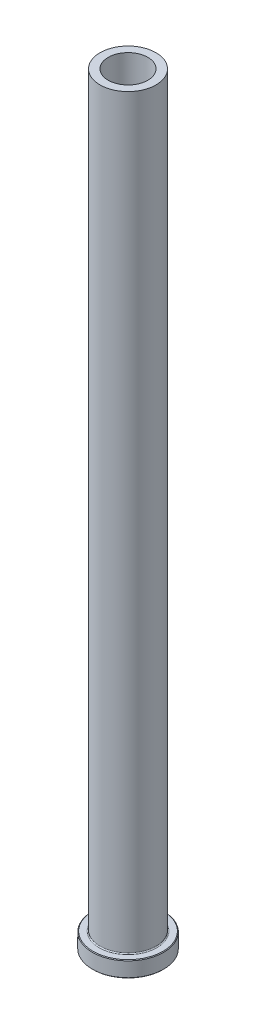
from build123d import *

# Parameters (mm, degrees)
CHAMFER1_SIZE = 0.254


with BuildPart() as part:
    # Sketch1 → Revolve1 (revolve)
    with BuildSketch(Plane.XY, mode=Mode.PRIVATE) as revolve1_sk:
        with BuildLine():
            Line((0, 0), (14.224, 0))
            Line((14.224, 0), (14.224, 6.35))
            Line((14.224, 6.35), (11.566525, 6.35))
            ThreePointArc((11.566525, 6.35), (11.285891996, 6.466241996), (11.16965, 6.746875))
            Line((11.16965, 6.746875), (11.16965, 304.8))
            Line((11.16965, 304.8), (0, 304.8))
            Line((0, 304.8), (0, 0))
        make_face()
    revolve(revolve1_sk.sketch.rotate(Axis((0, 0, 0), (0, 1, 0)), 90), axis=Axis((0, 0, 0), (0, 1, 0)))

    # Sketch2 → Cut-Revolve1 (revolve, cut)
    with BuildSketch(Plane.XY, mode=Mode.PRIVATE) as cut_revolve1_sk:
        Polygon((8.524875, 0), (8.128, 0.396875), (8.128, 230.3145), (7.9375, 244.602), (7.9375, 304.8), (0, 304.8), (0, 0), align=None)
    revolve(cut_revolve1_sk.sketch.rotate(Axis((0, 0, 0), (0, 1, 0)), 90), axis=Axis((0, 0, 0), (0, 1, 0)), mode=Mode.SUBTRACT)

    # Chamfer1
    chamfer1_edges = [part.edges().sort_by_distance(p)[0] for p in [
        (0, 6.35, 14.224),
        (0, 0, 14.224),
    ]]
    chamfer(chamfer1_edges, length=CHAMFER1_SIZE)


solid = part.part
